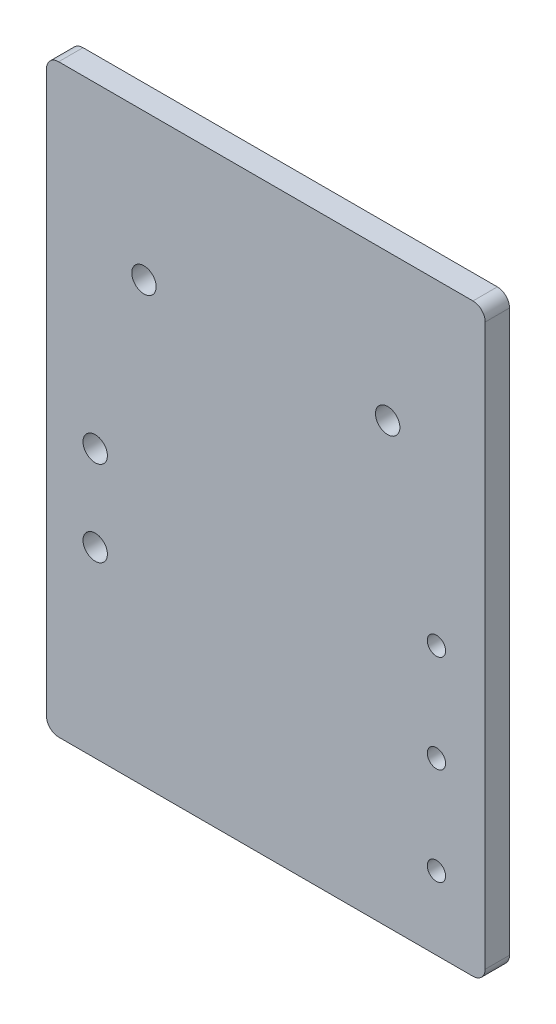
ISO-10303-21;
HEADER;
FILE_DESCRIPTION(('STEP AP214'),'2;1');
FILE_NAME('part.step','',(''),(''),'','','');
FILE_SCHEMA(('AUTOMOTIVE_DESIGN { 1 0 10303 214 1 1 1 1 }'));
ENDSEC;
DATA;
#1=APPLICATION_CONTEXT('core data for automotive mechanical design processes');
#2=APPLICATION_PROTOCOL_DEFINITION('international standard','automotive_design',2000,#1);
#3=PRODUCT_CONTEXT('',#1,'mechanical');
#4=PRODUCT('Part','Part','',(#3));
#5=PRODUCT_RELATED_PRODUCT_CATEGORY('part','',(#4));
#6=PRODUCT_DEFINITION_FORMATION('','',#4);
#7=PRODUCT_DEFINITION_CONTEXT('part definition',#1,'design');
#8=PRODUCT_DEFINITION('design','',#6,#7);
#9=PRODUCT_DEFINITION_SHAPE('','',#8);
#10=(LENGTH_UNIT() NAMED_UNIT(*) SI_UNIT(.MILLI.,.METRE.));
#11=(NAMED_UNIT(*) PLANE_ANGLE_UNIT() SI_UNIT($,.RADIAN.));
#12=(NAMED_UNIT(*) SI_UNIT($,.STERADIAN.) SOLID_ANGLE_UNIT());
#13=UNCERTAINTY_MEASURE_WITH_UNIT(LENGTH_MEASURE(1.E-05),#10,'distance_accuracy_value','');
#14=(GEOMETRIC_REPRESENTATION_CONTEXT(3) GLOBAL_UNCERTAINTY_ASSIGNED_CONTEXT((#13)) GLOBAL_UNIT_ASSIGNED_CONTEXT((#10,
#11,#12)) REPRESENTATION_CONTEXT('',''));
#15=CARTESIAN_POINT('',(0.,0.,0.));
#16=DIRECTION('',(0.,0.,1.));
#17=DIRECTION('',(1.,0.,0.));
#18=AXIS2_PLACEMENT_3D('',#15,#16,#17);
#19=CARTESIAN_POINT('',(0.,0.,6.35));
#20=DIRECTION('',(0.,0.,1.));
#21=DIRECTION('',(1.,0.,0.));
#22=AXIS2_PLACEMENT_3D('',#19,#20,#21);
#23=PLANE('',#22);
#24=CARTESIAN_POINT('',(44.45,44.45,6.35));
#25=DIRECTION('',(0.,0.,1.));
#26=DIRECTION('',(1.,0.,0.));
#27=AXIS2_PLACEMENT_3D('',#24,#25,#26);
#28=CIRCLE('',#27,2.38760000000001);
#29=CARTESIAN_POINT('',(46.8376,44.45,6.35));
#30=VERTEX_POINT('',#29);
#31=EDGE_CURVE('E202',#30,#30,#28,.T.);
#32=ORIENTED_EDGE('',*,*,#31,.F.);
#33=EDGE_LOOP('',(#32));
#34=FACE_BOUND('',#33,.T.);
#35=CARTESIAN_POINT('',(-44.45,69.85,6.35));
#36=DIRECTION('',(0.,0.,1.));
#37=DIRECTION('',(1.,0.,0.));
#38=AXIS2_PLACEMENT_3D('',#35,#36,#37);
#39=CIRCLE('',#38,3.17500000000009);
#40=CARTESIAN_POINT('',(-41.2749999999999,69.85,6.35));
#41=VERTEX_POINT('',#40);
#42=EDGE_CURVE('E190',#41,#41,#39,.T.);
#43=ORIENTED_EDGE('',*,*,#42,.F.);
#44=EDGE_LOOP('',(#43));
#45=FACE_BOUND('',#44,.T.);
#46=CARTESIAN_POINT('',(31.75,114.3,6.35));
#47=DIRECTION('',(0.,0.,1.));
#48=DIRECTION('',(1.,0.,0.));
#49=AXIS2_PLACEMENT_3D('',#46,#47,#48);
#50=CIRCLE('',#49,3.175);
#51=CARTESIAN_POINT('',(34.925,114.3,6.35));
#52=VERTEX_POINT('',#51);
#53=EDGE_CURVE('E179',#52,#52,#50,.T.);
#54=ORIENTED_EDGE('',*,*,#53,.F.);
#55=EDGE_LOOP('',(#54));
#56=FACE_BOUND('',#55,.T.);
#57=DIRECTION('',(0.,-1.,0.));
#58=VECTOR('',#57,1.);
#59=CARTESIAN_POINT('',(-57.15,152.4,6.35));
#60=LINE('',#59,#58);
#61=CARTESIAN_POINT('',(-57.15,149.225,6.35));
#62=VERTEX_POINT('',#61);
#63=CARTESIAN_POINT('',(-57.15,3.17500000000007,6.35));
#64=VERTEX_POINT('',#63);
#65=EDGE_CURVE('E135',#62,#64,#60,.T.);
#66=ORIENTED_EDGE('',*,*,#65,.T.);
#67=CARTESIAN_POINT('',(-53.975,3.175,6.35));
#68=DIRECTION('',(0.,0.,1.));
#69=DIRECTION('',(1.,0.,0.));
#70=AXIS2_PLACEMENT_3D('',#67,#68,#69);
#71=CIRCLE('',#70,3.175);
#72=CARTESIAN_POINT('',(-53.975,0.,6.35));
#73=VERTEX_POINT('',#72);
#74=EDGE_CURVE('E154',#64,#73,#71,.T.);
#75=ORIENTED_EDGE('',*,*,#74,.T.);
#76=DIRECTION('',(1.,0.,0.));
#77=VECTOR('',#76,1.);
#78=CARTESIAN_POINT('',(-57.15,0.,6.35));
#79=LINE('',#78,#77);
#80=CARTESIAN_POINT('',(53.975,0.,6.35));
#81=VERTEX_POINT('',#80);
#82=EDGE_CURVE('E118',#73,#81,#79,.T.);
#83=ORIENTED_EDGE('',*,*,#82,.T.);
#84=CARTESIAN_POINT('',(53.975,3.175,6.35));
#85=DIRECTION('',(0.,0.,1.));
#86=DIRECTION('',(1.,0.,0.));
#87=AXIS2_PLACEMENT_3D('',#84,#85,#86);
#88=CIRCLE('',#87,3.175);
#89=CARTESIAN_POINT('',(57.15,3.175,6.35));
#90=VERTEX_POINT('',#89);
#91=EDGE_CURVE('E152',#81,#90,#88,.T.);
#92=ORIENTED_EDGE('',*,*,#91,.T.);
#93=DIRECTION('',(0.,1.,0.));
#94=VECTOR('',#93,1.);
#95=CARTESIAN_POINT('',(57.15,0.,6.35));
#96=LINE('',#95,#94);
#97=CARTESIAN_POINT('',(57.15,149.225,6.35));
#98=VERTEX_POINT('',#97);
#99=EDGE_CURVE('E174',#90,#98,#96,.T.);
#100=ORIENTED_EDGE('',*,*,#99,.T.);
#101=CARTESIAN_POINT('',(53.975,149.225,6.35));
#102=DIRECTION('',(0.,0.,1.));
#103=DIRECTION('',(1.,0.,0.));
#104=AXIS2_PLACEMENT_3D('',#101,#102,#103);
#105=CIRCLE('',#104,3.175);
#106=CARTESIAN_POINT('',(53.975,152.4,6.35));
#107=VERTEX_POINT('',#106);
#108=EDGE_CURVE('E53',#98,#107,#105,.T.);
#109=ORIENTED_EDGE('',*,*,#108,.T.);
#110=DIRECTION('',(-1.,0.,0.));
#111=VECTOR('',#110,1.);
#112=CARTESIAN_POINT('',(57.15,152.4,6.35));
#113=LINE('',#112,#111);
#114=CARTESIAN_POINT('',(-53.975,152.4,6.35));
#115=VERTEX_POINT('',#114);
#116=EDGE_CURVE('E164',#107,#115,#113,.T.);
#117=ORIENTED_EDGE('',*,*,#116,.T.);
#118=CARTESIAN_POINT('',(-53.975,149.225,6.35));
#119=DIRECTION('',(0.,0.,1.));
#120=DIRECTION('',(1.,0.,0.));
#121=AXIS2_PLACEMENT_3D('',#118,#119,#120);
#122=CIRCLE('',#121,3.175);
#123=EDGE_CURVE('E150',#115,#62,#122,.T.);
#124=ORIENTED_EDGE('',*,*,#123,.T.);
#125=EDGE_LOOP('',(#66,#75,#83,#92,#100,#109,#117,#124));
#126=FACE_BOUND('',#125,.T.);
#127=CARTESIAN_POINT('',(-31.75,114.3,6.35));
#128=DIRECTION('',(0.,0.,1.));
#129=DIRECTION('',(1.,0.,0.));
#130=AXIS2_PLACEMENT_3D('',#127,#128,#129);
#131=CIRCLE('',#130,3.175);
#132=CARTESIAN_POINT('',(-28.575,114.3,6.35));
#133=VERTEX_POINT('',#132);
#134=EDGE_CURVE('E126',#133,#133,#131,.T.);
#135=ORIENTED_EDGE('',*,*,#134,.F.);
#136=EDGE_LOOP('',(#135));
#137=FACE_BOUND('',#136,.T.);
#138=CARTESIAN_POINT('',(-44.45,47.625,6.35));
#139=DIRECTION('',(0.,0.,1.));
#140=DIRECTION('',(1.,0.,0.));
#141=AXIS2_PLACEMENT_3D('',#138,#139,#140);
#142=CIRCLE('',#141,3.1750000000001);
#143=CARTESIAN_POINT('',(-41.2749999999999,47.625,6.35));
#144=VERTEX_POINT('',#143);
#145=EDGE_CURVE('E184',#144,#144,#142,.T.);
#146=ORIENTED_EDGE('',*,*,#145,.F.);
#147=EDGE_LOOP('',(#146));
#148=FACE_BOUND('',#147,.T.);
#149=CARTESIAN_POINT('',(44.45,19.05,6.35));
#150=DIRECTION('',(0.,0.,1.));
#151=DIRECTION('',(1.,0.,0.));
#152=AXIS2_PLACEMENT_3D('',#149,#150,#151);
#153=CIRCLE('',#152,2.38760000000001);
#154=CARTESIAN_POINT('',(46.8376,19.05,6.35));
#155=VERTEX_POINT('',#154);
#156=EDGE_CURVE('E196',#155,#155,#153,.T.);
#157=ORIENTED_EDGE('',*,*,#156,.F.);
#158=EDGE_LOOP('',(#157));
#159=FACE_BOUND('',#158,.T.);
#160=CARTESIAN_POINT('',(44.45,69.85,6.35));
#161=DIRECTION('',(0.,0.,1.));
#162=DIRECTION('',(1.,0.,0.));
#163=AXIS2_PLACEMENT_3D('',#160,#161,#162);
#164=CIRCLE('',#163,2.3876);
#165=CARTESIAN_POINT('',(46.8376,69.85,6.35));
#166=VERTEX_POINT('',#165);
#167=EDGE_CURVE('E208',#166,#166,#164,.T.);
#168=ORIENTED_EDGE('',*,*,#167,.F.);
#169=EDGE_LOOP('',(#168));
#170=FACE_BOUND('',#169,.T.);
#171=ADVANCED_FACE('F33',(#34,#45,#56,#126,#137,#148,#159,#170),#23,.T.);
#172=CARTESIAN_POINT('',(0.,0.,0.));
#173=DIRECTION('',(0.,0.,1.));
#174=DIRECTION('',(1.,0.,0.));
#175=AXIS2_PLACEMENT_3D('',#172,#173,#174);
#176=PLANE('',#175);
#177=CARTESIAN_POINT('',(44.45,44.45,0.));
#178=DIRECTION('',(0.,0.,1.));
#179=DIRECTION('',(1.,0.,0.));
#180=AXIS2_PLACEMENT_3D('',#177,#178,#179);
#181=CIRCLE('',#180,2.38760000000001);
#182=CARTESIAN_POINT('',(46.8376,44.45,0.));
#183=VERTEX_POINT('',#182);
#184=EDGE_CURVE('E205',#183,#183,#181,.T.);
#185=ORIENTED_EDGE('',*,*,#184,.T.);
#186=EDGE_LOOP('',(#185));
#187=FACE_BOUND('',#186,.T.);
#188=CARTESIAN_POINT('',(-44.45,69.85,0.));
#189=DIRECTION('',(0.,0.,1.));
#190=DIRECTION('',(1.,0.,0.));
#191=AXIS2_PLACEMENT_3D('',#188,#189,#190);
#192=CIRCLE('',#191,3.17500000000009);
#193=CARTESIAN_POINT('',(-41.2749999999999,69.85,0.));
#194=VERTEX_POINT('',#193);
#195=EDGE_CURVE('E193',#194,#194,#192,.T.);
#196=ORIENTED_EDGE('',*,*,#195,.T.);
#197=EDGE_LOOP('',(#196));
#198=FACE_BOUND('',#197,.T.);
#199=CARTESIAN_POINT('',(31.75,114.3,0.));
#200=DIRECTION('',(0.,0.,1.));
#201=DIRECTION('',(1.,0.,0.));
#202=AXIS2_PLACEMENT_3D('',#199,#200,#201);
#203=CIRCLE('',#202,3.175);
#204=CARTESIAN_POINT('',(34.925,114.3,0.));
#205=VERTEX_POINT('',#204);
#206=EDGE_CURVE('E181',#205,#205,#203,.T.);
#207=ORIENTED_EDGE('',*,*,#206,.T.);
#208=EDGE_LOOP('',(#207));
#209=FACE_BOUND('',#208,.T.);
#210=DIRECTION('',(1.,0.,0.));
#211=VECTOR('',#210,1.);
#212=CARTESIAN_POINT('',(0.,0.,0.));
#213=LINE('',#212,#211);
#214=CARTESIAN_POINT('',(-53.975,0.,0.));
#215=VERTEX_POINT('',#214);
#216=CARTESIAN_POINT('',(53.975,0.,0.));
#217=VERTEX_POINT('',#216);
#218=EDGE_CURVE('E115',#215,#217,#213,.T.);
#219=ORIENTED_EDGE('',*,*,#218,.F.);
#220=CARTESIAN_POINT('',(-53.975,3.175,0.));
#221=DIRECTION('',(0.,0.,1.));
#222=DIRECTION('',(1.,0.,0.));
#223=AXIS2_PLACEMENT_3D('',#220,#221,#222);
#224=CIRCLE('',#223,3.175);
#225=CARTESIAN_POINT('',(-57.15,3.17500000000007,0.));
#226=VERTEX_POINT('',#225);
#227=EDGE_CURVE('E98',#215,#226,#224,.F.);
#228=ORIENTED_EDGE('',*,*,#227,.T.);
#229=DIRECTION('',(0.,-1.,0.));
#230=VECTOR('',#229,1.);
#231=CARTESIAN_POINT('',(-57.15,152.4,0.));
#232=LINE('',#231,#230);
#233=CARTESIAN_POINT('',(-57.15,149.225,0.));
#234=VERTEX_POINT('',#233);
#235=EDGE_CURVE('E139',#234,#226,#232,.T.);
#236=ORIENTED_EDGE('',*,*,#235,.F.);
#237=CARTESIAN_POINT('',(-53.975,149.225,0.));
#238=DIRECTION('',(0.,0.,1.));
#239=DIRECTION('',(1.,0.,0.));
#240=AXIS2_PLACEMENT_3D('',#237,#238,#239);
#241=CIRCLE('',#240,3.175);
#242=CARTESIAN_POINT('',(-53.975,152.4,0.));
#243=VERTEX_POINT('',#242);
#244=EDGE_CURVE('E143',#234,#243,#241,.F.);
#245=ORIENTED_EDGE('',*,*,#244,.T.);
#246=DIRECTION('',(-1.,0.,0.));
#247=VECTOR('',#246,1.);
#248=CARTESIAN_POINT('',(57.15,152.4,0.));
#249=LINE('',#248,#247);
#250=CARTESIAN_POINT('',(53.975,152.4,0.));
#251=VERTEX_POINT('',#250);
#252=EDGE_CURVE('E129',#251,#243,#249,.T.);
#253=ORIENTED_EDGE('',*,*,#252,.F.);
#254=CARTESIAN_POINT('',(53.975,149.225,0.));
#255=DIRECTION('',(0.,0.,1.));
#256=DIRECTION('',(1.,0.,0.));
#257=AXIS2_PLACEMENT_3D('',#254,#255,#256);
#258=CIRCLE('',#257,3.175);
#259=CARTESIAN_POINT('',(57.15,149.225,0.));
#260=VERTEX_POINT('',#259);
#261=EDGE_CURVE('E119',#251,#260,#258,.F.);
#262=ORIENTED_EDGE('',*,*,#261,.T.);
#263=DIRECTION('',(0.,1.,0.));
#264=VECTOR('',#263,1.);
#265=CARTESIAN_POINT('',(57.15,0.,0.));
#266=LINE('',#265,#264);
#267=CARTESIAN_POINT('',(57.15,3.175,0.));
#268=VERTEX_POINT('',#267);
#269=EDGE_CURVE('E125',#268,#260,#266,.T.);
#270=ORIENTED_EDGE('',*,*,#269,.F.);
#271=CARTESIAN_POINT('',(53.975,3.175,0.));
#272=DIRECTION('',(0.,0.,1.));
#273=DIRECTION('',(1.,0.,0.));
#274=AXIS2_PLACEMENT_3D('',#271,#272,#273);
#275=CIRCLE('',#274,3.175);
#276=EDGE_CURVE('E109',#268,#217,#275,.F.);
#277=ORIENTED_EDGE('',*,*,#276,.T.);
#278=EDGE_LOOP('',(#219,#228,#236,#245,#253,#262,#270,#277));
#279=FACE_BOUND('',#278,.T.);
#280=CARTESIAN_POINT('',(-31.75,114.3,0.));
#281=DIRECTION('',(0.,0.,1.));
#282=DIRECTION('',(1.,0.,0.));
#283=AXIS2_PLACEMENT_3D('',#280,#281,#282);
#284=CIRCLE('',#283,3.175);
#285=CARTESIAN_POINT('',(-28.575,114.3,0.));
#286=VERTEX_POINT('',#285);
#287=EDGE_CURVE('E132',#286,#286,#284,.T.);
#288=ORIENTED_EDGE('',*,*,#287,.T.);
#289=EDGE_LOOP('',(#288));
#290=FACE_BOUND('',#289,.T.);
#291=CARTESIAN_POINT('',(-44.45,47.625,0.));
#292=DIRECTION('',(0.,0.,1.));
#293=DIRECTION('',(1.,0.,0.));
#294=AXIS2_PLACEMENT_3D('',#291,#292,#293);
#295=CIRCLE('',#294,3.1750000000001);
#296=CARTESIAN_POINT('',(-41.2749999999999,47.625,0.));
#297=VERTEX_POINT('',#296);
#298=EDGE_CURVE('E187',#297,#297,#295,.T.);
#299=ORIENTED_EDGE('',*,*,#298,.T.);
#300=EDGE_LOOP('',(#299));
#301=FACE_BOUND('',#300,.T.);
#302=CARTESIAN_POINT('',(44.45,19.05,0.));
#303=DIRECTION('',(0.,0.,1.));
#304=DIRECTION('',(1.,0.,0.));
#305=AXIS2_PLACEMENT_3D('',#302,#303,#304);
#306=CIRCLE('',#305,2.38760000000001);
#307=CARTESIAN_POINT('',(46.8376,19.05,0.));
#308=VERTEX_POINT('',#307);
#309=EDGE_CURVE('E199',#308,#308,#306,.T.);
#310=ORIENTED_EDGE('',*,*,#309,.T.);
#311=EDGE_LOOP('',(#310));
#312=FACE_BOUND('',#311,.T.);
#313=CARTESIAN_POINT('',(44.45,69.85,0.));
#314=DIRECTION('',(0.,0.,1.));
#315=DIRECTION('',(1.,0.,0.));
#316=AXIS2_PLACEMENT_3D('',#313,#314,#315);
#317=CIRCLE('',#316,2.3876);
#318=CARTESIAN_POINT('',(46.8376,69.85,0.));
#319=VERTEX_POINT('',#318);
#320=EDGE_CURVE('E211',#319,#319,#317,.T.);
#321=ORIENTED_EDGE('',*,*,#320,.T.);
#322=EDGE_LOOP('',(#321));
#323=FACE_BOUND('',#322,.T.);
#324=ADVANCED_FACE('F122',(#187,#198,#209,#279,#290,#301,#312,#323),#176,.F.);
#325=CARTESIAN_POINT('',(0.,0.,6.35));
#326=DIRECTION('',(0.,1.,0.));
#327=DIRECTION('',(-1.,0.,0.));
#328=AXIS2_PLACEMENT_3D('',#325,#326,#327);
#329=PLANE('',#328);
#330=ORIENTED_EDGE('',*,*,#82,.F.);
#331=DIRECTION('',(0.,0.,-1.));
#332=VECTOR('',#331,1.);
#333=CARTESIAN_POINT('',(-53.975,0.,6.35));
#334=LINE('',#333,#332);
#335=EDGE_CURVE('E102',#73,#215,#334,.T.);
#336=ORIENTED_EDGE('',*,*,#335,.T.);
#337=ORIENTED_EDGE('',*,*,#218,.T.);
#338=DIRECTION('',(0.,0.,-1.));
#339=VECTOR('',#338,1.);
#340=CARTESIAN_POINT('',(53.975,0.,6.35));
#341=LINE('',#340,#339);
#342=EDGE_CURVE('E120',#217,#81,#341,.F.);
#343=ORIENTED_EDGE('',*,*,#342,.T.);
#344=EDGE_LOOP('',(#330,#336,#337,#343));
#345=FACE_BOUND('',#344,.T.);
#346=ADVANCED_FACE('F114',(#345),#329,.F.);
#347=CARTESIAN_POINT('',(57.15,0.,6.35));
#348=DIRECTION('',(-1.,0.,0.));
#349=DIRECTION('',(0.,-1.,0.));
#350=AXIS2_PLACEMENT_3D('',#347,#348,#349);
#351=PLANE('',#350);
#352=ORIENTED_EDGE('',*,*,#99,.F.);
#353=DIRECTION('',(0.,0.,-1.));
#354=VECTOR('',#353,1.);
#355=CARTESIAN_POINT('',(57.15,3.175,6.35));
#356=LINE('',#355,#354);
#357=EDGE_CURVE('E158',#90,#268,#356,.T.);
#358=ORIENTED_EDGE('',*,*,#357,.T.);
#359=ORIENTED_EDGE('',*,*,#269,.T.);
#360=DIRECTION('',(0.,0.,-1.));
#361=VECTOR('',#360,1.);
#362=CARTESIAN_POINT('',(57.15,149.225,6.35));
#363=LINE('',#362,#361);
#364=EDGE_CURVE('E156',#260,#98,#363,.F.);
#365=ORIENTED_EDGE('',*,*,#364,.T.);
#366=EDGE_LOOP('',(#352,#358,#359,#365));
#367=FACE_BOUND('',#366,.T.);
#368=ADVANCED_FACE('F238',(#367),#351,.F.);
#369=CARTESIAN_POINT('',(57.15,152.4,6.35));
#370=DIRECTION('',(0.,-1.,0.));
#371=DIRECTION('',(0.,0.,-1.));
#372=AXIS2_PLACEMENT_3D('',#369,#370,#371);
#373=PLANE('',#372);
#374=ORIENTED_EDGE('',*,*,#252,.T.);
#375=DIRECTION('',(0.,0.,-1.));
#376=VECTOR('',#375,1.);
#377=CARTESIAN_POINT('',(-53.975,152.4,6.35));
#378=LINE('',#377,#376);
#379=EDGE_CURVE('E11',#243,#115,#378,.F.);
#380=ORIENTED_EDGE('',*,*,#379,.T.);
#381=ORIENTED_EDGE('',*,*,#116,.F.);
#382=DIRECTION('',(0.,0.,-1.));
#383=VECTOR('',#382,1.);
#384=CARTESIAN_POINT('',(53.975,152.4,6.35));
#385=LINE('',#384,#383);
#386=EDGE_CURVE('E41',#107,#251,#385,.T.);
#387=ORIENTED_EDGE('',*,*,#386,.T.);
#388=EDGE_LOOP('',(#374,#380,#381,#387));
#389=FACE_BOUND('',#388,.T.);
#390=ADVANCED_FACE('F163',(#389),#373,.F.);
#391=CARTESIAN_POINT('',(-57.15,152.4,6.35));
#392=DIRECTION('',(1.,0.,0.));
#393=DIRECTION('',(0.,1.,0.));
#394=AXIS2_PLACEMENT_3D('',#391,#392,#393);
#395=PLANE('',#394);
#396=ORIENTED_EDGE('',*,*,#235,.T.);
#397=DIRECTION('',(0.,0.,-1.));
#398=VECTOR('',#397,1.);
#399=CARTESIAN_POINT('',(-57.15,3.17500000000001,6.35));
#400=LINE('',#399,#398);
#401=EDGE_CURVE('E103',#226,#64,#400,.F.);
#402=ORIENTED_EDGE('',*,*,#401,.T.);
#403=ORIENTED_EDGE('',*,*,#65,.F.);
#404=DIRECTION('',(0.,0.,-1.));
#405=VECTOR('',#404,1.);
#406=CARTESIAN_POINT('',(-57.15,149.225,6.35));
#407=LINE('',#406,#405);
#408=EDGE_CURVE('E108',#62,#234,#407,.T.);
#409=ORIENTED_EDGE('',*,*,#408,.T.);
#410=EDGE_LOOP('',(#396,#402,#403,#409));
#411=FACE_BOUND('',#410,.T.);
#412=ADVANCED_FACE('F172',(#411),#395,.F.);
#413=CARTESIAN_POINT('',(-31.75,114.3,6.35));
#414=DIRECTION('',(0.,0.,-1.));
#415=DIRECTION('',(-1.,0.,0.));
#416=AXIS2_PLACEMENT_3D('',#413,#414,#415);
#417=CYLINDRICAL_SURFACE('',#416,3.175);
#418=ORIENTED_EDGE('',*,*,#134,.T.);
#419=EDGE_LOOP('',(#418));
#420=FACE_BOUND('',#419,.T.);
#421=ORIENTED_EDGE('',*,*,#287,.F.);
#422=EDGE_LOOP('',(#421));
#423=FACE_BOUND('',#422,.T.);
#424=ADVANCED_FACE('F231',(#420,#423),#417,.F.);
#425=CARTESIAN_POINT('',(31.75,114.3,6.35));
#426=DIRECTION('',(0.,0.,-1.));
#427=DIRECTION('',(-1.,0.,0.));
#428=AXIS2_PLACEMENT_3D('',#425,#426,#427);
#429=CYLINDRICAL_SURFACE('',#428,3.175);
#430=ORIENTED_EDGE('',*,*,#53,.T.);
#431=EDGE_LOOP('',(#430));
#432=FACE_BOUND('',#431,.T.);
#433=ORIENTED_EDGE('',*,*,#206,.F.);
#434=EDGE_LOOP('',(#433));
#435=FACE_BOUND('',#434,.T.);
#436=ADVANCED_FACE('F289',(#432,#435),#429,.F.);
#437=CARTESIAN_POINT('',(-44.45,47.625,6.35));
#438=DIRECTION('',(0.,0.,-1.));
#439=DIRECTION('',(-1.,0.,0.));
#440=AXIS2_PLACEMENT_3D('',#437,#438,#439);
#441=CYLINDRICAL_SURFACE('',#440,3.1750000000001);
#442=ORIENTED_EDGE('',*,*,#145,.T.);
#443=EDGE_LOOP('',(#442));
#444=FACE_BOUND('',#443,.T.);
#445=ORIENTED_EDGE('',*,*,#298,.F.);
#446=EDGE_LOOP('',(#445));
#447=FACE_BOUND('',#446,.T.);
#448=ADVANCED_FACE('F286',(#444,#447),#441,.F.);
#449=CARTESIAN_POINT('',(-44.45,69.85,6.35));
#450=DIRECTION('',(0.,0.,-1.));
#451=DIRECTION('',(-1.,0.,0.));
#452=AXIS2_PLACEMENT_3D('',#449,#450,#451);
#453=CYLINDRICAL_SURFACE('',#452,3.17500000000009);
#454=ORIENTED_EDGE('',*,*,#42,.T.);
#455=EDGE_LOOP('',(#454));
#456=FACE_BOUND('',#455,.T.);
#457=ORIENTED_EDGE('',*,*,#195,.F.);
#458=EDGE_LOOP('',(#457));
#459=FACE_BOUND('',#458,.T.);
#460=ADVANCED_FACE('F270',(#456,#459),#453,.F.);
#461=CARTESIAN_POINT('',(44.45,19.05,6.35));
#462=DIRECTION('',(0.,0.,-1.));
#463=DIRECTION('',(-1.,0.,0.));
#464=AXIS2_PLACEMENT_3D('',#461,#462,#463);
#465=CYLINDRICAL_SURFACE('',#464,2.38760000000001);
#466=ORIENTED_EDGE('',*,*,#156,.T.);
#467=EDGE_LOOP('',(#466));
#468=FACE_BOUND('',#467,.T.);
#469=ORIENTED_EDGE('',*,*,#309,.F.);
#470=EDGE_LOOP('',(#469));
#471=FACE_BOUND('',#470,.T.);
#472=ADVANCED_FACE('F266',(#468,#471),#465,.F.);
#473=CARTESIAN_POINT('',(44.45,44.45,6.35));
#474=DIRECTION('',(0.,0.,-1.));
#475=DIRECTION('',(-1.,0.,0.));
#476=AXIS2_PLACEMENT_3D('',#473,#474,#475);
#477=CYLINDRICAL_SURFACE('',#476,2.38760000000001);
#478=ORIENTED_EDGE('',*,*,#31,.T.);
#479=EDGE_LOOP('',(#478));
#480=FACE_BOUND('',#479,.T.);
#481=ORIENTED_EDGE('',*,*,#184,.F.);
#482=EDGE_LOOP('',(#481));
#483=FACE_BOUND('',#482,.T.);
#484=ADVANCED_FACE('F269',(#480,#483),#477,.F.);
#485=CARTESIAN_POINT('',(44.45,69.85,6.35));
#486=DIRECTION('',(0.,0.,-1.));
#487=DIRECTION('',(-1.,0.,0.));
#488=AXIS2_PLACEMENT_3D('',#485,#486,#487);
#489=CYLINDRICAL_SURFACE('',#488,2.3876);
#490=ORIENTED_EDGE('',*,*,#167,.T.);
#491=EDGE_LOOP('',(#490));
#492=FACE_BOUND('',#491,.T.);
#493=ORIENTED_EDGE('',*,*,#320,.F.);
#494=EDGE_LOOP('',(#493));
#495=FACE_BOUND('',#494,.T.);
#496=ADVANCED_FACE('F217',(#492,#495),#489,.F.);
#497=CARTESIAN_POINT('',(-53.975,3.175,6.35));
#498=DIRECTION('',(0.,0.,-1.));
#499=DIRECTION('',(-1.,0.,0.));
#500=AXIS2_PLACEMENT_3D('',#497,#498,#499);
#501=CYLINDRICAL_SURFACE('',#500,3.175);
#502=ORIENTED_EDGE('',*,*,#74,.F.);
#503=ORIENTED_EDGE('',*,*,#401,.F.);
#504=ORIENTED_EDGE('',*,*,#227,.F.);
#505=ORIENTED_EDGE('',*,*,#335,.F.);
#506=EDGE_LOOP('',(#502,#503,#504,#505));
#507=FACE_BOUND('',#506,.T.);
#508=ADVANCED_FACE('F101',(#507),#501,.T.);
#509=CARTESIAN_POINT('',(53.975,3.175,6.35));
#510=DIRECTION('',(0.,0.,-1.));
#511=DIRECTION('',(-1.,0.,0.));
#512=AXIS2_PLACEMENT_3D('',#509,#510,#511);
#513=CYLINDRICAL_SURFACE('',#512,3.175);
#514=ORIENTED_EDGE('',*,*,#91,.F.);
#515=ORIENTED_EDGE('',*,*,#342,.F.);
#516=ORIENTED_EDGE('',*,*,#276,.F.);
#517=ORIENTED_EDGE('',*,*,#357,.F.);
#518=EDGE_LOOP('',(#514,#515,#516,#517));
#519=FACE_BOUND('',#518,.T.);
#520=ADVANCED_FACE('F246',(#519),#513,.T.);
#521=CARTESIAN_POINT('',(-53.975,149.225,6.35));
#522=DIRECTION('',(0.,0.,-1.));
#523=DIRECTION('',(-1.,0.,0.));
#524=AXIS2_PLACEMENT_3D('',#521,#522,#523);
#525=CYLINDRICAL_SURFACE('',#524,3.175);
#526=ORIENTED_EDGE('',*,*,#123,.F.);
#527=ORIENTED_EDGE('',*,*,#379,.F.);
#528=ORIENTED_EDGE('',*,*,#244,.F.);
#529=ORIENTED_EDGE('',*,*,#408,.F.);
#530=EDGE_LOOP('',(#526,#527,#528,#529));
#531=FACE_BOUND('',#530,.T.);
#532=ADVANCED_FACE('F169',(#531),#525,.T.);
#533=CARTESIAN_POINT('',(53.975,149.225,6.35));
#534=DIRECTION('',(0.,0.,-1.));
#535=DIRECTION('',(-1.,0.,0.));
#536=AXIS2_PLACEMENT_3D('',#533,#534,#535);
#537=CYLINDRICAL_SURFACE('',#536,3.175);
#538=ORIENTED_EDGE('',*,*,#108,.F.);
#539=ORIENTED_EDGE('',*,*,#364,.F.);
#540=ORIENTED_EDGE('',*,*,#261,.F.);
#541=ORIENTED_EDGE('',*,*,#386,.F.);
#542=EDGE_LOOP('',(#538,#539,#540,#541));
#543=FACE_BOUND('',#542,.T.);
#544=ADVANCED_FACE('F35',(#543),#537,.T.);
#545=CLOSED_SHELL('',(#171,#324,#346,#368,#390,#412,#424,#436,#448,#460,#472,#484,#496,#508,
#520,#532,#544));
#546=MANIFOLD_SOLID_BREP('B2',#545);
#547=ADVANCED_BREP_SHAPE_REPRESENTATION('',(#18,#546),#14);
#548=SHAPE_DEFINITION_REPRESENTATION(#9,#547);
ENDSEC;
END-ISO-10303-21;
